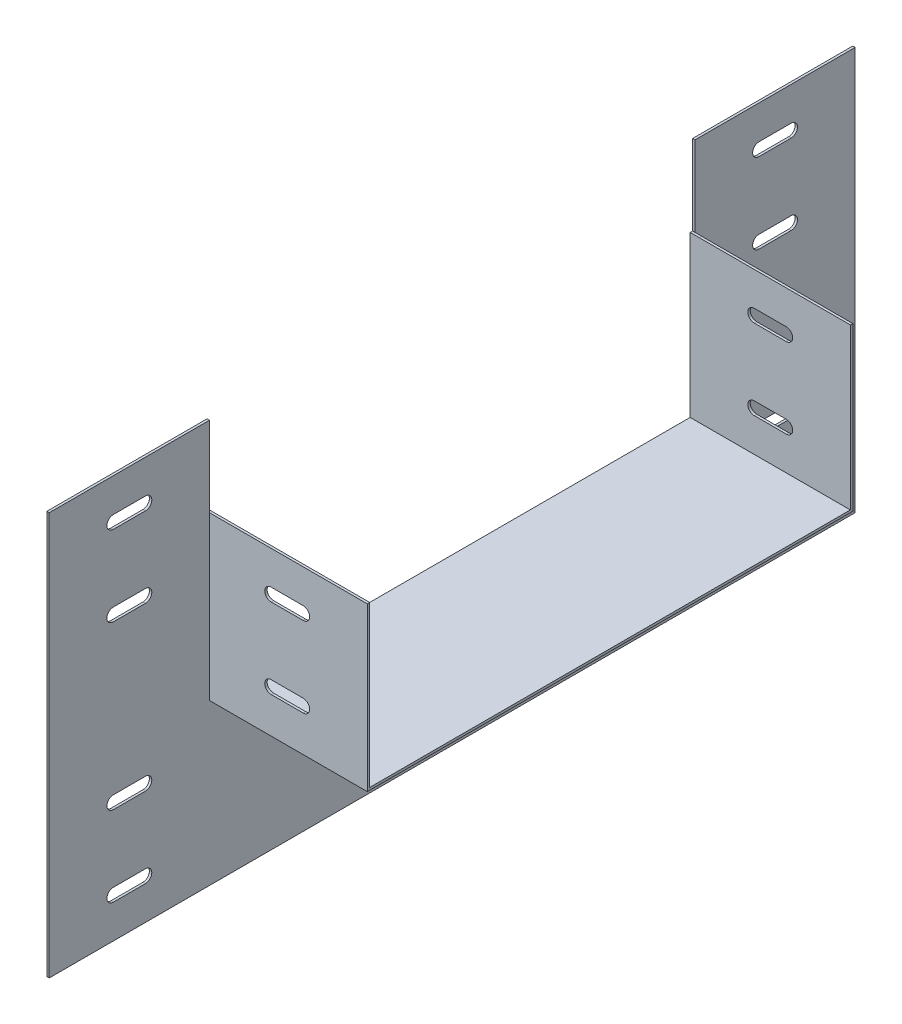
from build123d import *

# Parameters (mm, degrees)
SKETCH1_W                = 100
SKETCH1_H                = 300
BOSS_EXTRUDE1_DEPTH      = 1.5
EXTRUDE_THIN1_DEPTH      = 100
EXTRUDE_THIN1_DEPTH_BACK = 1.5
SKETCH2_W                = 100
SKETCH2_H                = 1.5
BOSS_EXTRUDE2_DEPTH      = 1.5
CUT_EXTRUDE1_DEPTH       = 310.438604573
CUT_EXTRUDE1_DEPTH_BACK  = 310.438604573
CUT_EXTRUDE2_DEPTH       = 309.957116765


with BuildPart() as part:
    # Sketch1 → Boss-Extrude1 (new body)
    with BuildSketch(Plane(origin=(0, 0, 0), x_dir=(1, 0, 0), z_dir=(0, 1, 0))):
        with Locations((50, 0)):
            Rectangle(SKETCH1_W, SKETCH1_H)
    extrude(amount=-BOSS_EXTRUDE1_DEPTH)

    # Sketch2 → Extrude-Thin1 (add, two sides: drawn at the far end of the back side and taken through both)
    with BuildSketch(Plane(origin=(0, 0, 0), x_dir=(1, 0, 0), z_dir=(0, 1, 0)).offset(-EXTRUDE_THIN1_DEPTH_BACK)):
        with Locations((50, -150.75)):
            Rectangle(SKETCH2_W, SKETCH2_H)
        with Locations((50, 150.75)):
            Rectangle(SKETCH2_W, SKETCH2_H)
    extrude(amount=EXTRUDE_THIN1_DEPTH + EXTRUDE_THIN1_DEPTH_BACK)

    # Sketch3 → Boss-Extrude2 (add)
    with BuildSketch(Plane(origin=(0, 0, 0), x_dir=(0, 0, -1), z_dir=(1, 0, 0))):
        Polygon((-151.5, 150), (-151.5, -1.5), (151.5, -1.5), (151.5, 150), (251.5, 150), (251.5, -101.5), (-251.5, -101.5), (-251.5, 150), align=None)
    extrude(amount=BOSS_EXTRUDE2_DEPTH)

    # Sketch4 → Cut-Extrude1 (cut, two sides: drawn at the far end of the back side and taken through both)
    with BuildSketch(Plane.XY.offset(-CUT_EXTRUDE1_DEPTH_BACK)):
        with BuildLine():
            Line((40, 79), (60, 79))
            ThreePointArc((60, 79), (64, 75), (60, 71))
            Line((60, 71), (40, 71))
            ThreePointArc((40, 71), (36, 75), (40, 79))
        make_face()
        with BuildLine():
            Line((40, 29), (60, 29))
            ThreePointArc((60, 29), (64, 25), (60, 21))
            Line((60, 21), (40, 21))
            ThreePointArc((40, 21), (36, 25), (40, 29))
        make_face()
    extrude(amount=CUT_EXTRUDE1_DEPTH + CUT_EXTRUDE1_DEPTH_BACK, mode=Mode.SUBTRACT)

    # Sketch5 → Cut-Extrude2 (cut, through all)
    with BuildSketch(Plane(origin=(1.5, 0, 0), x_dir=(0, 0, -1), z_dir=(1, 0, 0))):
        with BuildLine():
            Line((-211.5, 129), (-191.5, 129))
            ThreePointArc((-191.5, 129), (-187.5, 125), (-191.5, 121))
            Line((-191.5, 121), (-211.5, 121))
            ThreePointArc((-211.5, 121), (-215.5, 125), (-211.5, 129))
        make_face()
        with BuildLine():
            Line((-211.5, 79), (-191.5, 79))
            ThreePointArc((-191.5, 79), (-187.5, 75), (-191.5, 71))
            Line((-191.5, 71), (-211.5, 71))
            ThreePointArc((-211.5, 71), (-215.5, 75), (-211.5, 79))
        make_face()
        with BuildLine():
            Line((-211.5, -22.5), (-191.5, -22.5))
            ThreePointArc((-191.5, -22.5), (-187.5, -26.5), (-191.5, -30.5))
            Line((-191.5, -30.5), (-211.5, -30.5))
            ThreePointArc((-211.5, -30.5), (-215.5, -26.5), (-211.5, -22.5))
        make_face()
        with BuildLine():
            Line((-211.5, -72.5), (-191.5, -72.5))
            ThreePointArc((-191.5, -72.5), (-187.5, -76.5), (-191.5, -80.5))
            Line((-191.5, -80.5), (-211.5, -80.5))
            ThreePointArc((-211.5, -80.5), (-215.5, -76.5), (-211.5, -72.5))
        make_face()
        with BuildLine():
            Line((191.5, 129), (211.5, 129))
            ThreePointArc((211.5, 129), (215.5, 125), (211.5, 121))
            Line((211.5, 121), (191.5, 121))
            ThreePointArc((191.5, 121), (187.5, 125), (191.5, 129))
        make_face()
        with BuildLine():
            Line((191.5, 79), (211.5, 79))
            ThreePointArc((211.5, 79), (215.5, 75), (211.5, 71))
            Line((211.5, 71), (191.5, 71))
            ThreePointArc((191.5, 71), (187.5, 75), (191.5, 79))
        make_face()
        with BuildLine():
            Line((191.5, -22.5), (211.5, -22.5))
            ThreePointArc((211.5, -22.5), (215.5, -26.5), (211.5, -30.5))
            Line((211.5, -30.5), (191.5, -30.5))
            ThreePointArc((191.5, -30.5), (187.5, -26.5), (191.5, -22.5))
        make_face()
        with BuildLine():
            Line((191.5, -72.5), (211.5, -72.5))
            ThreePointArc((211.5, -72.5), (215.5, -76.5), (211.5, -80.5))
            Line((211.5, -80.5), (191.5, -80.5))
            ThreePointArc((191.5, -80.5), (187.5, -76.5), (191.5, -72.5))
        make_face()
    extrude(amount=-CUT_EXTRUDE2_DEPTH, mode=Mode.SUBTRACT)


solid = part.part
